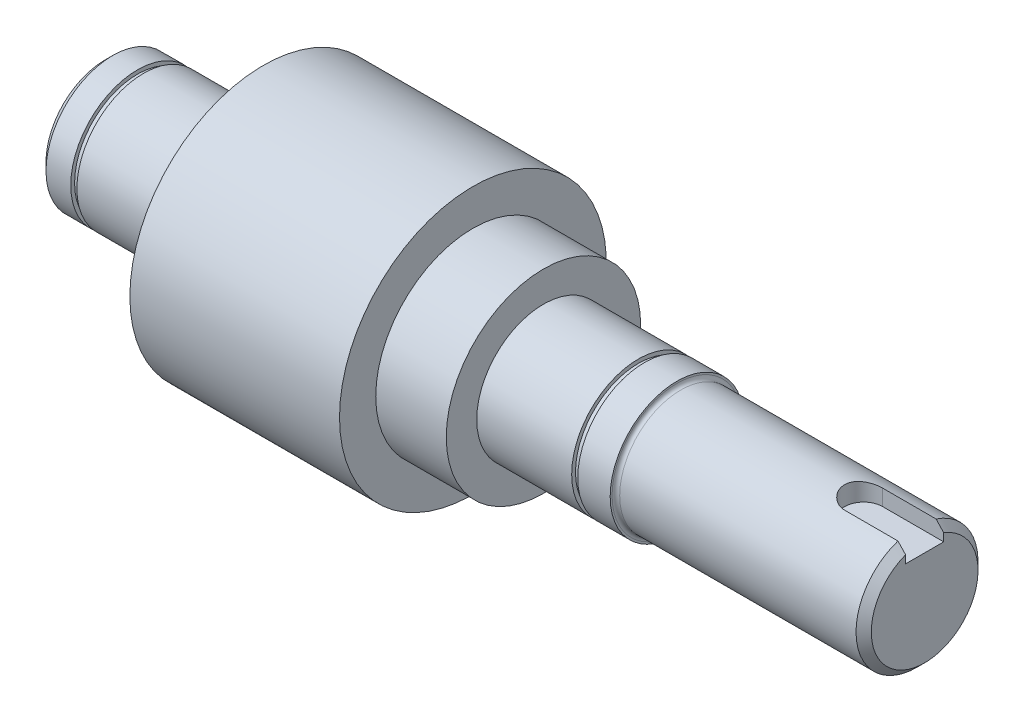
ISO-10303-21;
HEADER;
FILE_DESCRIPTION(('STEP AP214'),'2;1');
FILE_NAME('part.step','',(''),(''),'','','');
FILE_SCHEMA(('AUTOMOTIVE_DESIGN { 1 0 10303 214 1 1 1 1 }'));
ENDSEC;
DATA;
#1=APPLICATION_CONTEXT('core data for automotive mechanical design processes');
#2=APPLICATION_PROTOCOL_DEFINITION('international standard','automotive_design',2000,#1);
#3=PRODUCT_CONTEXT('',#1,'mechanical');
#4=PRODUCT('Part','Part','',(#3));
#5=PRODUCT_RELATED_PRODUCT_CATEGORY('part','',(#4));
#6=PRODUCT_DEFINITION_FORMATION('','',#4);
#7=PRODUCT_DEFINITION_CONTEXT('part definition',#1,'design');
#8=PRODUCT_DEFINITION('design','',#6,#7);
#9=PRODUCT_DEFINITION_SHAPE('','',#8);
#10=(LENGTH_UNIT() NAMED_UNIT(*) SI_UNIT(.MILLI.,.METRE.));
#11=(NAMED_UNIT(*) PLANE_ANGLE_UNIT() SI_UNIT($,.RADIAN.));
#12=(NAMED_UNIT(*) SI_UNIT($,.STERADIAN.) SOLID_ANGLE_UNIT());
#13=UNCERTAINTY_MEASURE_WITH_UNIT(LENGTH_MEASURE(1.E-05),#10,'distance_accuracy_value','');
#14=(GEOMETRIC_REPRESENTATION_CONTEXT(3) GLOBAL_UNCERTAINTY_ASSIGNED_CONTEXT((#13)) GLOBAL_UNIT_ASSIGNED_CONTEXT((#10,
#11,#12)) REPRESENTATION_CONTEXT('',''));
#15=CARTESIAN_POINT('',(0.,0.,0.));
#16=DIRECTION('',(0.,0.,1.));
#17=DIRECTION('',(1.,0.,0.));
#18=AXIS2_PLACEMENT_3D('',#15,#16,#17);
#19=CARTESIAN_POINT('',(-69.,17.5,0.));
#20=DIRECTION('',(1.,0.,0.));
#21=DIRECTION('',(0.,0.,-1.));
#22=AXIS2_PLACEMENT_3D('',#19,#20,#21);
#23=PLANE('',#22);
#24=CARTESIAN_POINT('',(-69.,0.,0.));
#25=DIRECTION('',(1.,0.,0.));
#26=DIRECTION('',(0.,0.,-1.));
#27=AXIS2_PLACEMENT_3D('',#24,#25,#26);
#28=CIRCLE('',#27,15.5);
#29=CARTESIAN_POINT('',(-69.,0.,-15.5));
#30=VERTEX_POINT('',#29);
#31=EDGE_CURVE('E170',#30,#30,#28,.F.);
#32=ORIENTED_EDGE('',*,*,#31,.T.);
#33=EDGE_LOOP('',(#32));
#34=FACE_BOUND('',#33,.T.);
#35=ADVANCED_FACE('F31',(#34),#23,.F.);
#36=CARTESIAN_POINT('',(-77.9876543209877,0.,0.));
#37=DIRECTION('',(-1.,0.,0.));
#38=DIRECTION('',(0.,0.,1.));
#39=AXIS2_PLACEMENT_3D('',#36,#37,#38);
#40=CYLINDRICAL_SURFACE('',#39,17.5);
#41=CARTESIAN_POINT('',(-67.,0.,0.));
#42=DIRECTION('',(1.,0.,0.));
#43=DIRECTION('',(0.,0.,-1.));
#44=AXIS2_PLACEMENT_3D('',#41,#42,#43);
#45=CIRCLE('',#44,17.5);
#46=CARTESIAN_POINT('',(-67.,0.,-17.5));
#47=VERTEX_POINT('',#46);
#48=EDGE_CURVE('E173',#47,#47,#45,.T.);
#49=ORIENTED_EDGE('',*,*,#48,.T.);
#50=EDGE_LOOP('',(#49));
#51=FACE_BOUND('',#50,.T.);
#52=CARTESIAN_POINT('',(-60.5,0.,0.));
#53=DIRECTION('',(-1.,0.,0.));
#54=DIRECTION('',(0.,0.,1.));
#55=AXIS2_PLACEMENT_3D('',#52,#53,#54);
#56=CIRCLE('',#55,17.5);
#57=CARTESIAN_POINT('',(-60.5,0.,17.5));
#58=VERTEX_POINT('',#57);
#59=EDGE_CURVE('E167',#58,#58,#56,.T.);
#60=ORIENTED_EDGE('',*,*,#59,.T.);
#61=EDGE_LOOP('',(#60));
#62=FACE_BOUND('',#61,.T.);
#63=ADVANCED_FACE('F209',(#51,#62),#40,.T.);
#64=CARTESIAN_POINT('',(-60.5,17.5,0.));
#65=DIRECTION('',(-1.,0.,0.));
#66=DIRECTION('',(0.,0.,1.));
#67=AXIS2_PLACEMENT_3D('',#64,#65,#66);
#68=PLANE('',#67);
#69=ORIENTED_EDGE('',*,*,#59,.F.);
#70=EDGE_LOOP('',(#69));
#71=FACE_BOUND('',#70,.T.);
#72=CARTESIAN_POINT('',(-60.5,0.,0.));
#73=DIRECTION('',(-1.,0.,0.));
#74=DIRECTION('',(0.,0.,1.));
#75=AXIS2_PLACEMENT_3D('',#72,#73,#74);
#76=CIRCLE('',#75,16.5);
#77=CARTESIAN_POINT('',(-60.5,0.,16.5));
#78=VERTEX_POINT('',#77);
#79=EDGE_CURVE('E164',#78,#78,#76,.T.);
#80=ORIENTED_EDGE('',*,*,#79,.T.);
#81=EDGE_LOOP('',(#80));
#82=FACE_BOUND('',#81,.T.);
#83=ADVANCED_FACE('F214',(#71,#82),#68,.F.);
#84=CARTESIAN_POINT('',(-77.9876543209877,0.,0.));
#85=DIRECTION('',(-1.,0.,0.));
#86=DIRECTION('',(0.,0.,1.));
#87=AXIS2_PLACEMENT_3D('',#84,#85,#86);
#88=CYLINDRICAL_SURFACE('',#87,16.5);
#89=ORIENTED_EDGE('',*,*,#79,.F.);
#90=EDGE_LOOP('',(#89));
#91=FACE_BOUND('',#90,.T.);
#92=CARTESIAN_POINT('',(-58.9,0.,0.));
#93=DIRECTION('',(-1.,0.,0.));
#94=DIRECTION('',(0.,0.,1.));
#95=AXIS2_PLACEMENT_3D('',#92,#93,#94);
#96=CIRCLE('',#95,16.5);
#97=CARTESIAN_POINT('',(-58.9,0.,16.5));
#98=VERTEX_POINT('',#97);
#99=EDGE_CURVE('E161',#98,#98,#96,.T.);
#100=ORIENTED_EDGE('',*,*,#99,.T.);
#101=EDGE_LOOP('',(#100));
#102=FACE_BOUND('',#101,.T.);
#103=ADVANCED_FACE('F295',(#91,#102),#88,.T.);
#104=CARTESIAN_POINT('',(-58.9,17.5,0.));
#105=DIRECTION('',(1.,0.,0.));
#106=DIRECTION('',(0.,0.,-1.));
#107=AXIS2_PLACEMENT_3D('',#104,#105,#106);
#108=PLANE('',#107);
#109=ORIENTED_EDGE('',*,*,#99,.F.);
#110=EDGE_LOOP('',(#109));
#111=FACE_BOUND('',#110,.T.);
#112=CARTESIAN_POINT('',(-58.9,0.,0.));
#113=DIRECTION('',(-1.,0.,0.));
#114=DIRECTION('',(0.,0.,1.));
#115=AXIS2_PLACEMENT_3D('',#112,#113,#114);
#116=CIRCLE('',#115,17.5);
#117=CARTESIAN_POINT('',(-58.9,0.,17.5));
#118=VERTEX_POINT('',#117);
#119=EDGE_CURVE('E158',#118,#118,#116,.T.);
#120=ORIENTED_EDGE('',*,*,#119,.T.);
#121=EDGE_LOOP('',(#120));
#122=FACE_BOUND('',#121,.T.);
#123=ADVANCED_FACE('F291',(#111,#122),#108,.F.);
#124=CARTESIAN_POINT('',(-77.9876543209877,0.,0.));
#125=DIRECTION('',(-1.,0.,0.));
#126=DIRECTION('',(0.,0.,1.));
#127=AXIS2_PLACEMENT_3D('',#124,#125,#126);
#128=CYLINDRICAL_SURFACE('',#127,17.5);
#129=ORIENTED_EDGE('',*,*,#119,.F.);
#130=EDGE_LOOP('',(#129));
#131=FACE_BOUND('',#130,.T.);
#132=CARTESIAN_POINT('',(-34.,0.,0.));
#133=DIRECTION('',(-1.,0.,0.));
#134=DIRECTION('',(0.,0.,1.));
#135=AXIS2_PLACEMENT_3D('',#132,#133,#134);
#136=CIRCLE('',#135,17.5);
#137=CARTESIAN_POINT('',(-34.,0.,17.5));
#138=VERTEX_POINT('',#137);
#139=EDGE_CURVE('E155',#138,#138,#136,.T.);
#140=ORIENTED_EDGE('',*,*,#139,.T.);
#141=EDGE_LOOP('',(#140));
#142=FACE_BOUND('',#141,.T.);
#143=ADVANCED_FACE('F287',(#131,#142),#128,.T.);
#144=CARTESIAN_POINT('',(-34.,25.5,0.));
#145=DIRECTION('',(1.,0.,0.));
#146=DIRECTION('',(0.,0.,-1.));
#147=AXIS2_PLACEMENT_3D('',#144,#145,#146);
#148=PLANE('',#147);
#149=ORIENTED_EDGE('',*,*,#139,.F.);
#150=EDGE_LOOP('',(#149));
#151=FACE_BOUND('',#150,.T.);
#152=CARTESIAN_POINT('',(-34.,0.,0.));
#153=DIRECTION('',(-1.,0.,0.));
#154=DIRECTION('',(0.,0.,1.));
#155=AXIS2_PLACEMENT_3D('',#152,#153,#154);
#156=CIRCLE('',#155,25.5);
#157=CARTESIAN_POINT('',(-34.,0.,25.5));
#158=VERTEX_POINT('',#157);
#159=EDGE_CURVE('E152',#158,#158,#156,.T.);
#160=ORIENTED_EDGE('',*,*,#159,.T.);
#161=EDGE_LOOP('',(#160));
#162=FACE_BOUND('',#161,.T.);
#163=ADVANCED_FACE('F283',(#151,#162),#148,.F.);
#164=CARTESIAN_POINT('',(-77.9876543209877,0.,0.));
#165=DIRECTION('',(-1.,0.,0.));
#166=DIRECTION('',(0.,0.,1.));
#167=AXIS2_PLACEMENT_3D('',#164,#165,#166);
#168=CYLINDRICAL_SURFACE('',#167,25.5);
#169=ORIENTED_EDGE('',*,*,#159,.F.);
#170=EDGE_LOOP('',(#169));
#171=FACE_BOUND('',#170,.T.);
#172=CARTESIAN_POINT('',(-27.5,0.,0.));
#173=DIRECTION('',(-1.,0.,0.));
#174=DIRECTION('',(0.,0.,1.));
#175=AXIS2_PLACEMENT_3D('',#172,#173,#174);
#176=CIRCLE('',#175,25.5);
#177=CARTESIAN_POINT('',(-27.5,0.,25.5));
#178=VERTEX_POINT('',#177);
#179=EDGE_CURVE('E149',#178,#178,#176,.T.);
#180=ORIENTED_EDGE('',*,*,#179,.T.);
#181=EDGE_LOOP('',(#180));
#182=FACE_BOUND('',#181,.T.);
#183=ADVANCED_FACE('F279',(#171,#182),#168,.T.);
#184=CARTESIAN_POINT('',(-27.5,35.,0.));
#185=DIRECTION('',(1.,0.,0.));
#186=DIRECTION('',(0.,0.,-1.));
#187=AXIS2_PLACEMENT_3D('',#184,#185,#186);
#188=PLANE('',#187);
#189=ORIENTED_EDGE('',*,*,#179,.F.);
#190=EDGE_LOOP('',(#189));
#191=FACE_BOUND('',#190,.T.);
#192=CARTESIAN_POINT('',(-27.5,0.,0.));
#193=DIRECTION('',(-1.,0.,0.));
#194=DIRECTION('',(0.,0.,1.));
#195=AXIS2_PLACEMENT_3D('',#192,#193,#194);
#196=CIRCLE('',#195,35.);
#197=CARTESIAN_POINT('',(-27.5,0.,35.));
#198=VERTEX_POINT('',#197);
#199=EDGE_CURVE('E146',#198,#198,#196,.T.);
#200=ORIENTED_EDGE('',*,*,#199,.T.);
#201=EDGE_LOOP('',(#200));
#202=FACE_BOUND('',#201,.T.);
#203=ADVANCED_FACE('F275',(#191,#202),#188,.F.);
#204=CARTESIAN_POINT('',(-77.9876543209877,0.,0.));
#205=DIRECTION('',(-1.,0.,0.));
#206=DIRECTION('',(0.,0.,1.));
#207=AXIS2_PLACEMENT_3D('',#204,#205,#206);
#208=CYLINDRICAL_SURFACE('',#207,35.);
#209=ORIENTED_EDGE('',*,*,#199,.F.);
#210=EDGE_LOOP('',(#209));
#211=FACE_BOUND('',#210,.T.);
#212=CARTESIAN_POINT('',(27.5,0.,0.));
#213=DIRECTION('',(-1.,0.,0.));
#214=DIRECTION('',(0.,0.,1.));
#215=AXIS2_PLACEMENT_3D('',#212,#213,#214);
#216=CIRCLE('',#215,35.);
#217=CARTESIAN_POINT('',(27.5,0.,35.));
#218=VERTEX_POINT('',#217);
#219=EDGE_CURVE('E143',#218,#218,#216,.T.);
#220=ORIENTED_EDGE('',*,*,#219,.T.);
#221=EDGE_LOOP('',(#220));
#222=FACE_BOUND('',#221,.T.);
#223=ADVANCED_FACE('F271',(#211,#222),#208,.T.);
#224=CARTESIAN_POINT('',(27.5,35.,0.));
#225=DIRECTION('',(-1.,0.,0.));
#226=DIRECTION('',(0.,0.,1.));
#227=AXIS2_PLACEMENT_3D('',#224,#225,#226);
#228=PLANE('',#227);
#229=ORIENTED_EDGE('',*,*,#219,.F.);
#230=EDGE_LOOP('',(#229));
#231=FACE_BOUND('',#230,.T.);
#232=CARTESIAN_POINT('',(27.5,0.,0.));
#233=DIRECTION('',(-1.,0.,0.));
#234=DIRECTION('',(0.,0.,1.));
#235=AXIS2_PLACEMENT_3D('',#232,#233,#234);
#236=CIRCLE('',#235,25.5);
#237=CARTESIAN_POINT('',(27.5,0.,25.5));
#238=VERTEX_POINT('',#237);
#239=EDGE_CURVE('E140',#238,#238,#236,.T.);
#240=ORIENTED_EDGE('',*,*,#239,.T.);
#241=EDGE_LOOP('',(#240));
#242=FACE_BOUND('',#241,.T.);
#243=ADVANCED_FACE('F267',(#231,#242),#228,.F.);
#244=CARTESIAN_POINT('',(-77.9876543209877,0.,0.));
#245=DIRECTION('',(-1.,0.,0.));
#246=DIRECTION('',(0.,0.,1.));
#247=AXIS2_PLACEMENT_3D('',#244,#245,#246);
#248=CYLINDRICAL_SURFACE('',#247,25.5);
#249=ORIENTED_EDGE('',*,*,#239,.F.);
#250=EDGE_LOOP('',(#249));
#251=FACE_BOUND('',#250,.T.);
#252=CARTESIAN_POINT('',(46.,0.,0.));
#253=DIRECTION('',(-1.,0.,0.));
#254=DIRECTION('',(0.,0.,1.));
#255=AXIS2_PLACEMENT_3D('',#252,#253,#254);
#256=CIRCLE('',#255,25.5);
#257=CARTESIAN_POINT('',(46.,0.,25.5));
#258=VERTEX_POINT('',#257);
#259=EDGE_CURVE('E137',#258,#258,#256,.T.);
#260=ORIENTED_EDGE('',*,*,#259,.T.);
#261=EDGE_LOOP('',(#260));
#262=FACE_BOUND('',#261,.T.);
#263=ADVANCED_FACE('F263',(#251,#262),#248,.T.);
#264=CARTESIAN_POINT('',(46.,25.5,0.));
#265=DIRECTION('',(-1.,0.,0.));
#266=DIRECTION('',(0.,0.,1.));
#267=AXIS2_PLACEMENT_3D('',#264,#265,#266);
#268=PLANE('',#267);
#269=ORIENTED_EDGE('',*,*,#259,.F.);
#270=EDGE_LOOP('',(#269));
#271=FACE_BOUND('',#270,.T.);
#272=CARTESIAN_POINT('',(46.,0.,0.));
#273=DIRECTION('',(-1.,0.,0.));
#274=DIRECTION('',(0.,0.,1.));
#275=AXIS2_PLACEMENT_3D('',#272,#273,#274);
#276=CIRCLE('',#275,17.5);
#277=CARTESIAN_POINT('',(46.,0.,17.5));
#278=VERTEX_POINT('',#277);
#279=EDGE_CURVE('E134',#278,#278,#276,.T.);
#280=ORIENTED_EDGE('',*,*,#279,.T.);
#281=EDGE_LOOP('',(#280));
#282=FACE_BOUND('',#281,.T.);
#283=ADVANCED_FACE('F259',(#271,#282),#268,.F.);
#284=CARTESIAN_POINT('',(-77.9876543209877,0.,0.));
#285=DIRECTION('',(-1.,0.,0.));
#286=DIRECTION('',(0.,0.,1.));
#287=AXIS2_PLACEMENT_3D('',#284,#285,#286);
#288=CYLINDRICAL_SURFACE('',#287,17.5);
#289=ORIENTED_EDGE('',*,*,#279,.F.);
#290=EDGE_LOOP('',(#289));
#291=FACE_BOUND('',#290,.T.);
#292=CARTESIAN_POINT('',(70.9,0.,0.));
#293=DIRECTION('',(-1.,0.,0.));
#294=DIRECTION('',(0.,0.,1.));
#295=AXIS2_PLACEMENT_3D('',#292,#293,#294);
#296=CIRCLE('',#295,17.5);
#297=CARTESIAN_POINT('',(70.9,0.,17.5));
#298=VERTEX_POINT('',#297);
#299=EDGE_CURVE('E131',#298,#298,#296,.T.);
#300=ORIENTED_EDGE('',*,*,#299,.T.);
#301=EDGE_LOOP('',(#300));
#302=FACE_BOUND('',#301,.T.);
#303=ADVANCED_FACE('F255',(#291,#302),#288,.T.);
#304=CARTESIAN_POINT('',(70.9,17.5,0.));
#305=DIRECTION('',(-1.,0.,0.));
#306=DIRECTION('',(0.,0.,1.));
#307=AXIS2_PLACEMENT_3D('',#304,#305,#306);
#308=PLANE('',#307);
#309=ORIENTED_EDGE('',*,*,#299,.F.);
#310=EDGE_LOOP('',(#309));
#311=FACE_BOUND('',#310,.T.);
#312=CARTESIAN_POINT('',(70.9,0.,0.));
#313=DIRECTION('',(-1.,0.,0.));
#314=DIRECTION('',(0.,0.,1.));
#315=AXIS2_PLACEMENT_3D('',#312,#313,#314);
#316=CIRCLE('',#315,16.5);
#317=CARTESIAN_POINT('',(70.9,0.,16.5));
#318=VERTEX_POINT('',#317);
#319=EDGE_CURVE('E128',#318,#318,#316,.T.);
#320=ORIENTED_EDGE('',*,*,#319,.T.);
#321=EDGE_LOOP('',(#320));
#322=FACE_BOUND('',#321,.T.);
#323=ADVANCED_FACE('F251',(#311,#322),#308,.F.);
#324=CARTESIAN_POINT('',(-77.9876543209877,0.,0.));
#325=DIRECTION('',(-1.,0.,0.));
#326=DIRECTION('',(0.,0.,1.));
#327=AXIS2_PLACEMENT_3D('',#324,#325,#326);
#328=CYLINDRICAL_SURFACE('',#327,16.5);
#329=ORIENTED_EDGE('',*,*,#319,.F.);
#330=EDGE_LOOP('',(#329));
#331=FACE_BOUND('',#330,.T.);
#332=CARTESIAN_POINT('',(72.5,0.,0.));
#333=DIRECTION('',(-1.,0.,0.));
#334=DIRECTION('',(0.,0.,1.));
#335=AXIS2_PLACEMENT_3D('',#332,#333,#334);
#336=CIRCLE('',#335,16.5);
#337=CARTESIAN_POINT('',(72.5,0.,16.5));
#338=VERTEX_POINT('',#337);
#339=EDGE_CURVE('E125',#338,#338,#336,.T.);
#340=ORIENTED_EDGE('',*,*,#339,.T.);
#341=EDGE_LOOP('',(#340));
#342=FACE_BOUND('',#341,.T.);
#343=ADVANCED_FACE('F247',(#331,#342),#328,.T.);
#344=CARTESIAN_POINT('',(72.5,17.5,0.));
#345=DIRECTION('',(1.,0.,0.));
#346=DIRECTION('',(0.,0.,-1.));
#347=AXIS2_PLACEMENT_3D('',#344,#345,#346);
#348=PLANE('',#347);
#349=ORIENTED_EDGE('',*,*,#339,.F.);
#350=EDGE_LOOP('',(#349));
#351=FACE_BOUND('',#350,.T.);
#352=CARTESIAN_POINT('',(72.5,0.,0.));
#353=DIRECTION('',(-1.,0.,0.));
#354=DIRECTION('',(0.,0.,1.));
#355=AXIS2_PLACEMENT_3D('',#352,#353,#354);
#356=CIRCLE('',#355,17.5);
#357=CARTESIAN_POINT('',(72.5,0.,17.5));
#358=VERTEX_POINT('',#357);
#359=EDGE_CURVE('E122',#358,#358,#356,.T.);
#360=ORIENTED_EDGE('',*,*,#359,.T.);
#361=EDGE_LOOP('',(#360));
#362=FACE_BOUND('',#361,.T.);
#363=ADVANCED_FACE('F243',(#351,#362),#348,.F.);
#364=CARTESIAN_POINT('',(-77.9876543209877,0.,0.));
#365=DIRECTION('',(-1.,0.,0.));
#366=DIRECTION('',(0.,0.,1.));
#367=AXIS2_PLACEMENT_3D('',#364,#365,#366);
#368=CYLINDRICAL_SURFACE('',#367,17.5);
#369=ORIENTED_EDGE('',*,*,#359,.F.);
#370=EDGE_LOOP('',(#369));
#371=FACE_BOUND('',#370,.T.);
#372=CARTESIAN_POINT('',(81.,0.,0.));
#373=DIRECTION('',(-1.,0.,0.));
#374=DIRECTION('',(0.,0.,1.));
#375=AXIS2_PLACEMENT_3D('',#372,#373,#374);
#376=CIRCLE('',#375,17.5);
#377=CARTESIAN_POINT('',(81.,0.,17.5));
#378=VERTEX_POINT('',#377);
#379=EDGE_CURVE('E119',#378,#378,#376,.T.);
#380=ORIENTED_EDGE('',*,*,#379,.T.);
#381=EDGE_LOOP('',(#380));
#382=FACE_BOUND('',#381,.T.);
#383=ADVANCED_FACE('F239',(#371,#382),#368,.T.);
#384=CARTESIAN_POINT('',(81.,17.5,0.));
#385=DIRECTION('',(-1.,0.,0.));
#386=DIRECTION('',(0.,0.,1.));
#387=AXIS2_PLACEMENT_3D('',#384,#385,#386);
#388=PLANE('',#387);
#389=ORIENTED_EDGE('',*,*,#379,.F.);
#390=EDGE_LOOP('',(#389));
#391=FACE_BOUND('',#390,.T.);
#392=CARTESIAN_POINT('',(81.,0.,0.));
#393=DIRECTION('',(-1.,0.,0.));
#394=DIRECTION('',(0.,0.,1.));
#395=AXIS2_PLACEMENT_3D('',#392,#393,#394);
#396=CIRCLE('',#395,17.);
#397=CARTESIAN_POINT('',(81.,0.,17.));
#398=VERTEX_POINT('',#397);
#399=EDGE_CURVE('E116',#398,#398,#396,.T.);
#400=ORIENTED_EDGE('',*,*,#399,.T.);
#401=EDGE_LOOP('',(#400));
#402=FACE_BOUND('',#401,.T.);
#403=ADVANCED_FACE('F235',(#391,#402),#388,.F.);
#404=CARTESIAN_POINT('',(82.,0.,0.));
#405=DIRECTION('',(-1.,0.,0.));
#406=DIRECTION('',(0.,0.,1.));
#407=AXIS2_PLACEMENT_3D('',#404,#405,#406);
#408=TOROIDAL_SURFACE('',#407,17.,1.);
#409=ORIENTED_EDGE('',*,*,#399,.F.);
#410=EDGE_LOOP('',(#409));
#411=FACE_BOUND('',#410,.T.);
#412=CARTESIAN_POINT('',(82.,0.,0.));
#413=DIRECTION('',(-1.,0.,0.));
#414=DIRECTION('',(0.,0.,1.));
#415=AXIS2_PLACEMENT_3D('',#412,#413,#414);
#416=CIRCLE('',#415,16.);
#417=CARTESIAN_POINT('',(82.,0.,16.));
#418=VERTEX_POINT('',#417);
#419=EDGE_CURVE('E113',#418,#418,#416,.T.);
#420=ORIENTED_EDGE('',*,*,#419,.T.);
#421=EDGE_LOOP('',(#420));
#422=FACE_BOUND('',#421,.T.);
#423=ADVANCED_FACE('F231',(#411,#422),#408,.F.);
#424=CARTESIAN_POINT('',(-77.9876543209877,0.,0.));
#425=DIRECTION('',(-1.,0.,0.));
#426=DIRECTION('',(0.,0.,1.));
#427=AXIS2_PLACEMENT_3D('',#424,#425,#426);
#428=CYLINDRICAL_SURFACE('',#427,16.);
#429=DIRECTION('',(-1.,0.,0.));
#430=VECTOR('',#429,1.);
#431=CARTESIAN_POINT('',(-77.9876543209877,15.1986841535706,5.00000000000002));
#432=LINE('',#431,#430);
#433=CARTESIAN_POINT('',(144.,15.1986841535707,4.99999999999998));
#434=VERTEX_POINT('',#433);
#435=CARTESIAN_POINT('',(130.,15.1986841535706,4.99999999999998));
#436=VERTEX_POINT('',#435);
#437=EDGE_CURVE('E50',#434,#436,#432,.T.);
#438=ORIENTED_EDGE('',*,*,#437,.T.);
#439=CARTESIAN_POINT('',(130.,15.1986841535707,4.99999999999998));
#440=CARTESIAN_POINT('',(129.863070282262,15.1986635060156,5.00001876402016));
#441=CARTESIAN_POINT('',(129.726148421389,15.2005339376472,4.99437589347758));
#442=CARTESIAN_POINT('',(129.453355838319,15.2079058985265,4.97190660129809));
#443=CARTESIAN_POINT('',(129.317484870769,15.2134065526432,4.95508287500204));
#444=CARTESIAN_POINT('',(129.04812437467,15.2278686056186,4.91045141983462));
#445=CARTESIAN_POINT('',(128.914629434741,15.2368206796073,4.88267328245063));
#446=CARTESIAN_POINT('',(128.650587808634,15.2579029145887,4.81639022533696));
#447=CARTESIAN_POINT('',(128.520041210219,15.2700331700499,4.77788498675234));
#448=CARTESIAN_POINT('',(128.262861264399,15.2971014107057,4.69049837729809));
#449=CARTESIAN_POINT('',(128.136225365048,15.3120375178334,4.64162394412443));
#450=CARTESIAN_POINT('',(127.88757697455,15.3442856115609,4.53387888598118));
#451=CARTESIAN_POINT('',(127.765566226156,15.3615984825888,4.47500453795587));
#452=CARTESIAN_POINT('',(127.40761093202,15.4163884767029,4.28398711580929));
#453=CARTESIAN_POINT('',(127.17960831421,15.4567319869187,4.13740351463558));
#454=CARTESIAN_POINT('',(126.744047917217,15.5420083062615,3.80477014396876));
#455=CARTESIAN_POINT('',(126.537341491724,15.5870445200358,3.61763914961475));
#456=CARTESIAN_POINT('',(126.157632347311,15.6757673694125,3.21145982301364));
#457=CARTESIAN_POINT('',(125.984635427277,15.7194537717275,2.99240601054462));
#458=CARTESIAN_POINT('',(125.673549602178,15.8017432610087,2.52249761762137));
#459=CARTESIAN_POINT('',(125.536338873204,15.8402090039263,2.27103576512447));
#460=CARTESIAN_POINT('',(125.306492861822,15.9065031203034,1.74720631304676));
#461=CARTESIAN_POINT('',(125.213845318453,15.9343344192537,1.47484448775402));
#462=CARTESIAN_POINT('',(125.078595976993,15.9754868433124,0.925860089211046));
#463=CARTESIAN_POINT('',(125.034537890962,15.989229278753,0.649628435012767));
#464=CARTESIAN_POINT('',(124.993102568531,16.0021438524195,0.0933690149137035));
#465=CARTESIAN_POINT('',(124.995715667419,16.0013190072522,-0.186657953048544));
#466=CARTESIAN_POINT('',(125.046593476,15.9854845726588,-0.7322995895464));
#467=CARTESIAN_POINT('',(125.093278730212,15.9709657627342,-0.998078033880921));
#468=CARTESIAN_POINT('',(125.22838031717,15.9299791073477,-1.51781473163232));
#469=CARTESIAN_POINT('',(125.316798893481,15.90351061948,-1.77177234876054));
#470=CARTESIAN_POINT('',(125.533883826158,15.8409378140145,-2.26431537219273));
#471=CARTESIAN_POINT('',(125.663029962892,15.8047194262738,-2.50267435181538));
#472=CARTESIAN_POINT('',(125.957476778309,15.7264700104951,-2.95480608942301));
#473=CARTESIAN_POINT('',(126.122786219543,15.6844375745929,-3.16857286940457));
#474=CARTESIAN_POINT('',(126.49311366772,15.5969449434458,-3.57495597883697));
#475=CARTESIAN_POINT('',(126.699497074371,15.5514148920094,-3.76632311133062));
#476=CARTESIAN_POINT('',(127.031025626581,15.4855747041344,-4.02553989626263));
#477=CARTESIAN_POINT('',(127.145280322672,15.464023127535,-4.10735324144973));
#478=CARTESIAN_POINT('',(127.380438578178,15.4223452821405,-4.26117389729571));
#479=CARTESIAN_POINT('',(127.501339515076,15.4022184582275,-4.33318503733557));
#480=CARTESIAN_POINT('',(127.750533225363,15.3637482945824,-4.46768370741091));
#481=CARTESIAN_POINT('',(127.878898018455,15.3454296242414,-4.53004475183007));
#482=CARTESIAN_POINT('',(128.140736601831,15.3114343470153,-4.64365087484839));
#483=CARTESIAN_POINT('',(128.274208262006,15.2957566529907,-4.69490052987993));
#484=CARTESIAN_POINT('',(128.545207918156,15.2675565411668,-4.78581076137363));
#485=CARTESIAN_POINT('',(128.682731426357,15.2550307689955,-4.82548366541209));
#486=CARTESIAN_POINT('',(128.960881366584,15.2335336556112,-4.89292357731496));
#487=CARTESIAN_POINT('',(129.10150634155,15.2245606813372,-4.92069605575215));
#488=CARTESIAN_POINT('',(129.368313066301,15.2112927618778,-4.96155201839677));
#489=CARTESIAN_POINT('',(129.494271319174,15.2065749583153,-4.97596872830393));
#490=CARTESIAN_POINT('',(129.746816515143,15.2002655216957,-4.99519230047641));
#491=CARTESIAN_POINT('',(129.873402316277,15.1986694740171,-5.00001273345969));
#492=CARTESIAN_POINT('',(130.,15.1986841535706,-5.00000000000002));
#493=B_SPLINE_CURVE_WITH_KNOTS('',3,(#439,#440,#441,#442,#443,#444,#445,#446,#447,#448,#449,
#450,#451,#452,#453,#454,#455,#456,#457,#458,#459,#460,#461,#462,#463,#464,#465,#466,#467,#468,
#469,#470,#471,#472,#473,#474,#475,#476,#477,#478,#479,#480,#481,#482,#483,#484,#485,#486,#487,
#488,#489,#490,#491,#492),.UNSPECIFIED.,.F.,.F.,(4,2,2,2,2,2,2,2,2,2,2,2,2,2,2,2,2,2,2,2,2,2,2,
2,2,2,4),(0.,0.410647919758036,0.821196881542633,1.23064432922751,1.64010394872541,
2.04929047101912,2.45862967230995,3.27688279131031,4.12046514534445,4.96419248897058,
5.82700574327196,6.68958147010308,7.52553600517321,8.36131743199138,9.16823951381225,
9.9752049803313,10.7920560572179,11.609105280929,12.4601312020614,12.8862315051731,
13.3121648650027,13.7432787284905,14.174214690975,14.604690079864,15.0349673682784,
15.4151752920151,15.7948451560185),.UNSPECIFIED.);
#494=CARTESIAN_POINT('',(130.,15.1986841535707,-5.00000000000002));
#495=VERTEX_POINT('',#494);
#496=EDGE_CURVE('E11',#436,#495,#493,.T.);
#497=ORIENTED_EDGE('',*,*,#496,.T.);
#498=DIRECTION('',(-1.,0.,0.));
#499=VECTOR('',#498,1.);
#500=CARTESIAN_POINT('',(-77.9876543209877,15.1986841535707,-4.99999999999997));
#501=LINE('',#500,#499);
#502=CARTESIAN_POINT('',(144.,15.1986841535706,-5.00000000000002));
#503=VERTEX_POINT('',#502);
#504=EDGE_CURVE('E111',#495,#503,#501,.F.);
#505=ORIENTED_EDGE('',*,*,#504,.T.);
#506=CARTESIAN_POINT('',(144.,0.,0.));
#507=DIRECTION('',(-1.,0.,0.));
#508=DIRECTION('',(0.,0.,1.));
#509=AXIS2_PLACEMENT_3D('',#506,#507,#508);
#510=CIRCLE('',#509,16.);
#511=EDGE_CURVE('E176',#503,#434,#510,.T.);
#512=ORIENTED_EDGE('',*,*,#511,.T.);
#513=EDGE_LOOP('',(#438,#497,#505,#512));
#514=FACE_BOUND('',#513,.T.);
#515=ORIENTED_EDGE('',*,*,#419,.F.);
#516=EDGE_LOOP('',(#515));
#517=FACE_BOUND('',#516,.T.);
#518=ADVANCED_FACE('F224',(#514,#517),#428,.T.);
#519=CARTESIAN_POINT('',(146.,16.,0.));
#520=DIRECTION('',(-1.,0.,0.));
#521=DIRECTION('',(0.,0.,1.));
#522=AXIS2_PLACEMENT_3D('',#519,#520,#521);
#523=PLANE('',#522);
#524=CARTESIAN_POINT('',(146.,0.,0.));
#525=DIRECTION('',(-1.,0.,0.));
#526=DIRECTION('',(0.,0.,1.));
#527=AXIS2_PLACEMENT_3D('',#524,#525,#526);
#528=CIRCLE('',#527,14.);
#529=CARTESIAN_POINT('',(146.,13.0766968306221,4.99999999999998));
#530=VERTEX_POINT('',#529);
#531=CARTESIAN_POINT('',(146.,13.0766968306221,-5.00000000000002));
#532=VERTEX_POINT('',#531);
#533=EDGE_CURVE('E179',#530,#532,#528,.F.);
#534=ORIENTED_EDGE('',*,*,#533,.T.);
#535=DIRECTION('',(0.,1.,0.));
#536=VECTOR('',#535,1.);
#537=CARTESIAN_POINT('',(146.,11.,-5.00000000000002));
#538=LINE('',#537,#536);
#539=CARTESIAN_POINT('',(146.,11.,-5.00000000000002));
#540=VERTEX_POINT('',#539);
#541=EDGE_CURVE('E107',#540,#532,#538,.T.);
#542=ORIENTED_EDGE('',*,*,#541,.F.);
#543=DIRECTION('',(0.,0.,-1.));
#544=VECTOR('',#543,1.);
#545=CARTESIAN_POINT('',(146.,11.,-5.00000000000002));
#546=LINE('',#545,#544);
#547=CARTESIAN_POINT('',(146.,11.,4.99999999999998));
#548=VERTEX_POINT('',#547);
#549=EDGE_CURVE('E97',#548,#540,#546,.T.);
#550=ORIENTED_EDGE('',*,*,#549,.F.);
#551=DIRECTION('',(0.,1.,0.));
#552=VECTOR('',#551,1.);
#553=CARTESIAN_POINT('',(146.,11.,4.99999999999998));
#554=LINE('',#553,#552);
#555=EDGE_CURVE('E88',#548,#530,#554,.T.);
#556=ORIENTED_EDGE('',*,*,#555,.T.);
#557=EDGE_LOOP('',(#534,#542,#550,#556));
#558=FACE_BOUND('',#557,.T.);
#559=ADVANCED_FACE('F219',(#558),#523,.F.);
#560=CARTESIAN_POINT('',(-69.,0.,0.));
#561=DIRECTION('',(1.,0.,0.));
#562=DIRECTION('',(0.,0.,-1.));
#563=AXIS2_PLACEMENT_3D('',#560,#561,#562);
#564=CONICAL_SURFACE('',#563,15.5,0.785398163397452);
#565=ORIENTED_EDGE('',*,*,#48,.F.);
#566=EDGE_LOOP('',(#565));
#567=FACE_BOUND('',#566,.T.);
#568=ORIENTED_EDGE('',*,*,#31,.F.);
#569=EDGE_LOOP('',(#568));
#570=FACE_BOUND('',#569,.T.);
#571=ADVANCED_FACE('F206',(#567,#570),#564,.T.);
#572=CARTESIAN_POINT('',(144.,0.,0.));
#573=DIRECTION('',(-1.,0.,0.));
#574=DIRECTION('',(0.,0.,1.));
#575=AXIS2_PLACEMENT_3D('',#572,#573,#574);
#576=CONICAL_SURFACE('',#575,16.,0.785398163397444);
#577=CARTESIAN_POINT('',(152.723871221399,5.28602402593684,-5.00000000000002));
#578=CARTESIAN_POINT('',(152.618996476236,5.4303539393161,-5.00000000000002));
#579=CARTESIAN_POINT('',(152.512826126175,5.5737329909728,-5.00000000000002));
#580=CARTESIAN_POINT('',(152.298265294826,5.85880582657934,-5.00000000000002));
#581=CARTESIAN_POINT('',(152.189874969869,6.00049972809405,-5.00000000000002));
#582=CARTESIAN_POINT('',(151.971259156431,6.28240189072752,-5.00000000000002));
#583=CARTESIAN_POINT('',(151.861034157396,6.42261053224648,-5.00000000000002));
#584=CARTESIAN_POINT('',(151.638990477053,6.70176324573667,-5.00000000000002));
#585=CARTESIAN_POINT('',(151.527171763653,6.84070729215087,-5.00000000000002));
#586=CARTESIAN_POINT('',(151.189818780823,7.25570974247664,-5.00000000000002));
#587=CARTESIAN_POINT('',(150.96224998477,7.53011479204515,-5.00000000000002));
#588=CARTESIAN_POINT('',(150.503034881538,8.07551448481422,-5.00000000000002));
#589=CARTESIAN_POINT('',(150.271388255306,8.34650885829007,-5.00000000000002));
#590=CARTESIAN_POINT('',(149.805169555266,8.88554118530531,-5.00000000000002));
#591=CARTESIAN_POINT('',(149.570600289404,9.15358157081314,-5.00000000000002));
#592=CARTESIAN_POINT('',(149.099008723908,9.68747943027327,-5.00000000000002));
#593=CARTESIAN_POINT('',(148.861986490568,9.95333696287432,-5.00000000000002));
#594=CARTESIAN_POINT('',(148.385938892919,10.4833188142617,-5.00000000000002));
#595=CARTESIAN_POINT('',(148.146913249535,10.7474428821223,-5.00000000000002));
#596=CARTESIAN_POINT('',(147.667259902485,11.2742332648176,-5.00000000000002));
#597=CARTESIAN_POINT('',(147.426632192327,11.5368995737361,-5.00000000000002));
#598=CARTESIAN_POINT('',(147.056808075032,11.9385582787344,-5.00000000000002));
#599=CARTESIAN_POINT('',(146.928084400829,12.0779864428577,-5.00000000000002));
#600=CARTESIAN_POINT('',(146.670300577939,12.3565234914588,-5.00000000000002));
#601=CARTESIAN_POINT('',(146.541240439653,12.4956323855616,-5.00000000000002));
#602=CARTESIAN_POINT('',(146.153564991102,12.9125603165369,-5.00000000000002));
#603=CARTESIAN_POINT('',(145.894485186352,13.1899474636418,-5.00000000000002));
#604=CARTESIAN_POINT('',(145.018224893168,14.1246706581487,-5.00000000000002));
#605=CARTESIAN_POINT('',(144.398677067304,14.7797870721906,-5.00000000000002));
#606=CARTESIAN_POINT('',(143.155710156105,16.0863398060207,-5.00000000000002));
#607=CARTESIAN_POINT('',(142.532291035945,16.7377760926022,-5.00000000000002));
#608=CARTESIAN_POINT('',(141.282986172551,18.0377061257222,-5.00000000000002));
#609=CARTESIAN_POINT('',(140.657101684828,18.6862010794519,-5.00000000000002));
#610=CARTESIAN_POINT('',(139.716767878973,19.6574672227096,-5.00000000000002));
#611=CARTESIAN_POINT('',(139.403076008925,19.9809725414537,-5.00000000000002));
#612=CARTESIAN_POINT('',(138.775250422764,20.6275534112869,-5.00000000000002));
#613=CARTESIAN_POINT('',(138.46111670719,20.9506289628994,-5.00000000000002));
#614=CARTESIAN_POINT('',(138.14679322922,21.2735198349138,-5.00000000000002));
#615=B_SPLINE_CURVE_WITH_KNOTS('',3,(#577,#578,#579,#580,#581,#582,#583,#584,#585,#586,#587,
#588,#589,#590,#591,#592,#593,#594,#595,#596,#597,#598,#599,#600,#601,#602,#603,#604,#605,#606,
#607,#608,#609,#610,#611,#612,#613,#614),.UNSPECIFIED.,.F.,.F.,(4,2,2,2,2,2,2,2,2,2,2,2,2,2,2,2,
2,2,4),(0.,0.535209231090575,1.07038090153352,1.60541201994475,2.14045392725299,3.2098667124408,
4.2793635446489,5.34790185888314,6.41641136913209,7.48507228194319,8.55373752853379,
9.12302606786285,9.6922972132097,10.8309746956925,13.5359707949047,16.2409912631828,
18.9447772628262,20.2966366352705,21.6484943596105),.UNSPECIFIED.);
#616=EDGE_CURVE('E43',#532,#503,#615,.T.);
#617=ORIENTED_EDGE('',*,*,#616,.F.);
#618=ORIENTED_EDGE('',*,*,#533,.F.);
#619=CARTESIAN_POINT('',(138.146793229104,21.2735198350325,4.99999999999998));
#620=CARTESIAN_POINT('',(138.461309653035,20.9504307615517,4.99999999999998));
#621=CARTESIAN_POINT('',(138.775636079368,20.6271567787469,4.99999999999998));
#622=CARTESIAN_POINT('',(139.403846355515,19.980178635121,4.99999999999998));
#623=CARTESIAN_POINT('',(139.717730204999,19.6564744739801,4.99999999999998));
#624=CARTESIAN_POINT('',(140.658570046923,18.684681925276,4.99999999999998));
#625=CARTESIAN_POINT('',(141.284767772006,18.0358586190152,4.99999999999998));
#626=CARTESIAN_POINT('',(142.533999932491,16.7359916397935,4.99999999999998));
#627=CARTESIAN_POINT('',(143.157036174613,16.0849497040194,4.99999999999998));
#628=CARTESIAN_POINT('',(144.399305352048,14.7791228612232,4.99999999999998));
#629=CARTESIAN_POINT('',(145.018537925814,14.1243376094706,4.99999999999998));
#630=CARTESIAN_POINT('',(145.943387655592,13.1377818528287,4.99999999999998));
#631=CARTESIAN_POINT('',(146.251159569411,12.8080318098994,4.99999999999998));
#632=CARTESIAN_POINT('',(146.864894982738,12.1468579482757,4.99999999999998));
#633=CARTESIAN_POINT('',(147.170858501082,11.8154341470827,4.99999999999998));
#634=CARTESIAN_POINT('',(147.780439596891,11.1505726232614,4.99999999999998));
#635=CARTESIAN_POINT('',(148.084057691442,10.8171353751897,4.99999999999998));
#636=CARTESIAN_POINT('',(148.688373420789,10.1475958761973,4.99999999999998));
#637=CARTESIAN_POINT('',(148.989070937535,9.81149351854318,4.99999999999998));
#638=CARTESIAN_POINT('',(149.586864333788,9.13555241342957,4.99999999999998));
#639=CARTESIAN_POINT('',(149.883956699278,8.79571055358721,4.99999999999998));
#640=CARTESIAN_POINT('',(150.472860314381,8.11152570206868,4.99999999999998));
#641=CARTESIAN_POINT('',(150.764672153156,7.76718322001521,4.99999999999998));
#642=CARTESIAN_POINT('',(151.196937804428,7.24591374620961,4.99999999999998));
#643=CARTESIAN_POINT('',(151.340173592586,7.07129418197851,4.99999999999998));
#644=CARTESIAN_POINT('',(151.624385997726,6.72023328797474,4.99999999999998));
#645=CARTESIAN_POINT('',(151.765362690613,6.5437920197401,4.99999999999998));
#646=CARTESIAN_POINT('',(152.044638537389,6.18868850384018,4.99999999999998));
#647=CARTESIAN_POINT('',(152.182936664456,6.0100254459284,4.99999999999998));
#648=CARTESIAN_POINT('',(152.456131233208,5.65008754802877,4.99999999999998));
#649=CARTESIAN_POINT('',(152.591027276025,5.46881240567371,4.99999999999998));
#650=CARTESIAN_POINT('',(152.723871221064,5.28602402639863,4.99999999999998));
#651=B_SPLINE_CURVE_WITH_KNOTS('',3,(#619,#620,#621,#622,#623,#624,#625,#626,#627,#628,#629,
#630,#631,#632,#633,#634,#635,#636,#637,#638,#639,#640,#641,#642,#643,#644,#645,#646,#647,#648,
#649,#650),.UNSPECIFIED.,.F.,.F.,(4,2,2,2,2,2,2,2,2,2,2,2,2,2,2,4),(0.,1.35268754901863,
2.70537610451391,5.41052347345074,8.11389502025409,10.8175196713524,12.1707063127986,
13.5238788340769,14.8767439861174,16.2296635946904,17.5838102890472,18.9378049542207,
19.6153418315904,20.2928558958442,20.9706247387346,21.6484726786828),.UNSPECIFIED.);
#652=EDGE_CURVE('E182',#434,#530,#651,.T.);
#653=ORIENTED_EDGE('',*,*,#652,.F.);
#654=ORIENTED_EDGE('',*,*,#511,.F.);
#655=EDGE_LOOP('',(#617,#618,#653,#654));
#656=FACE_BOUND('',#655,.T.);
#657=ADVANCED_FACE('F192',(#656),#576,.T.);
#658=CARTESIAN_POINT('',(130.,11.,0.));
#659=DIRECTION('',(0.,1.,0.));
#660=DIRECTION('',(0.,0.,1.));
#661=AXIS2_PLACEMENT_3D('',#658,#659,#660);
#662=CYLINDRICAL_SURFACE('',#661,5.);
#663=DIRECTION('',(0.,1.,0.));
#664=VECTOR('',#663,1.);
#665=CARTESIAN_POINT('',(130.,11.,4.99999999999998));
#666=LINE('',#665,#664);
#667=CARTESIAN_POINT('',(130.,11.,4.99999999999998));
#668=VERTEX_POINT('',#667);
#669=EDGE_CURVE('E81',#668,#436,#666,.T.);
#670=ORIENTED_EDGE('',*,*,#669,.F.);
#671=CARTESIAN_POINT('',(130.,11.,0.));
#672=DIRECTION('',(0.,1.,0.));
#673=DIRECTION('',(0.,0.,1.));
#674=AXIS2_PLACEMENT_3D('',#671,#672,#673);
#675=CIRCLE('',#674,5.);
#676=CARTESIAN_POINT('',(130.,11.,-5.00000000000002));
#677=VERTEX_POINT('',#676);
#678=EDGE_CURVE('E86',#677,#668,#675,.T.);
#679=ORIENTED_EDGE('',*,*,#678,.F.);
#680=DIRECTION('',(0.,1.,0.));
#681=VECTOR('',#680,1.);
#682=CARTESIAN_POINT('',(130.,11.,-5.00000000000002));
#683=LINE('',#682,#681);
#684=EDGE_CURVE('E105',#677,#495,#683,.T.);
#685=ORIENTED_EDGE('',*,*,#684,.T.);
#686=ORIENTED_EDGE('',*,*,#496,.F.);
#687=EDGE_LOOP('',(#670,#679,#685,#686));
#688=FACE_BOUND('',#687,.T.);
#689=ADVANCED_FACE('F83',(#688),#662,.F.);
#690=CARTESIAN_POINT('',(130.,11.,-5.00000000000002));
#691=DIRECTION('',(0.,0.,-1.));
#692=DIRECTION('',(-1.,0.,0.));
#693=AXIS2_PLACEMENT_3D('',#690,#691,#692);
#694=PLANE('',#693);
#695=ORIENTED_EDGE('',*,*,#684,.F.);
#696=DIRECTION('',(-1.,0.,0.));
#697=VECTOR('',#696,1.);
#698=CARTESIAN_POINT('',(130.,11.,-5.00000000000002));
#699=LINE('',#698,#697);
#700=EDGE_CURVE('E89',#540,#677,#699,.T.);
#701=ORIENTED_EDGE('',*,*,#700,.F.);
#702=ORIENTED_EDGE('',*,*,#541,.T.);
#703=ORIENTED_EDGE('',*,*,#616,.T.);
#704=ORIENTED_EDGE('',*,*,#504,.F.);
#705=EDGE_LOOP('',(#695,#701,#702,#703,#704));
#706=FACE_BOUND('',#705,.T.);
#707=ADVANCED_FACE('F197',(#706),#694,.F.);
#708=CARTESIAN_POINT('',(130.,11.,4.99999999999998));
#709=DIRECTION('',(0.,0.,1.));
#710=DIRECTION('',(1.,0.,0.));
#711=AXIS2_PLACEMENT_3D('',#708,#709,#710);
#712=PLANE('',#711);
#713=ORIENTED_EDGE('',*,*,#652,.T.);
#714=ORIENTED_EDGE('',*,*,#555,.F.);
#715=DIRECTION('',(1.,0.,0.));
#716=VECTOR('',#715,1.);
#717=CARTESIAN_POINT('',(130.,11.,4.99999999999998));
#718=LINE('',#717,#716);
#719=EDGE_CURVE('E92',#668,#548,#718,.T.);
#720=ORIENTED_EDGE('',*,*,#719,.F.);
#721=ORIENTED_EDGE('',*,*,#669,.T.);
#722=ORIENTED_EDGE('',*,*,#437,.F.);
#723=EDGE_LOOP('',(#713,#714,#720,#721,#722));
#724=FACE_BOUND('',#723,.T.);
#725=ADVANCED_FACE('F93',(#724),#712,.F.);
#726=CARTESIAN_POINT('',(130.,11.,0.));
#727=DIRECTION('',(0.,1.,0.));
#728=DIRECTION('',(0.,0.,1.));
#729=AXIS2_PLACEMENT_3D('',#726,#727,#728);
#730=PLANE('',#729);
#731=ORIENTED_EDGE('',*,*,#678,.T.);
#732=ORIENTED_EDGE('',*,*,#719,.T.);
#733=ORIENTED_EDGE('',*,*,#549,.T.);
#734=ORIENTED_EDGE('',*,*,#700,.T.);
#735=EDGE_LOOP('',(#731,#732,#733,#734));
#736=FACE_BOUND('',#735,.T.);
#737=ADVANCED_FACE('F99',(#736),#730,.T.);
#738=CLOSED_SHELL('',(#35,#63,#83,#103,#123,#143,#163,#183,#203,#223,#243,#263,#283,#303,#323,
#343,#363,#383,#403,#423,#518,#559,#571,#657,#689,#707,#725,#737));
#739=MANIFOLD_SOLID_BREP('B2',#738);
#740=ADVANCED_BREP_SHAPE_REPRESENTATION('',(#18,#739),#14);
#741=SHAPE_DEFINITION_REPRESENTATION(#9,#740);
ENDSEC;
END-ISO-10303-21;
